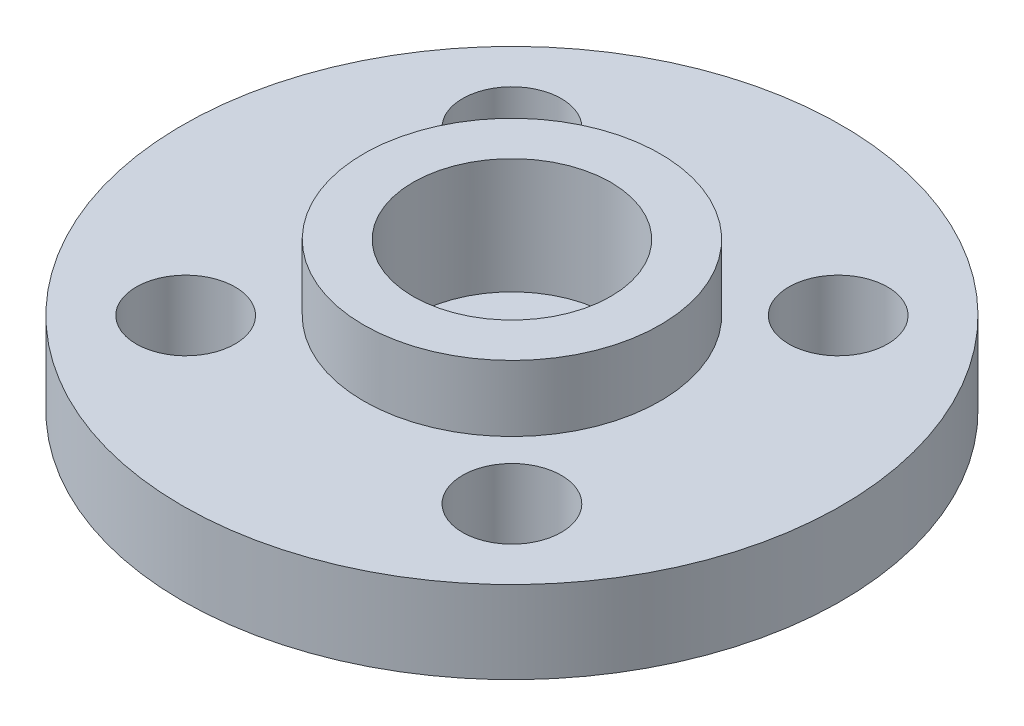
ISO-10303-21;
HEADER;
FILE_DESCRIPTION(('STEP AP214'),'2;1');
FILE_NAME('part.step','',(''),(''),'','','');
FILE_SCHEMA(('AUTOMOTIVE_DESIGN { 1 0 10303 214 1 1 1 1 }'));
ENDSEC;
DATA;
#1=APPLICATION_CONTEXT('core data for automotive mechanical design processes');
#2=APPLICATION_PROTOCOL_DEFINITION('international standard','automotive_design',2000,#1);
#3=PRODUCT_CONTEXT('',#1,'mechanical');
#4=PRODUCT('Part','Part','',(#3));
#5=PRODUCT_RELATED_PRODUCT_CATEGORY('part','',(#4));
#6=PRODUCT_DEFINITION_FORMATION('','',#4);
#7=PRODUCT_DEFINITION_CONTEXT('part definition',#1,'design');
#8=PRODUCT_DEFINITION('design','',#6,#7);
#9=PRODUCT_DEFINITION_SHAPE('','',#8);
#10=(LENGTH_UNIT() NAMED_UNIT(*) SI_UNIT(.MILLI.,.METRE.));
#11=(NAMED_UNIT(*) PLANE_ANGLE_UNIT() SI_UNIT($,.RADIAN.));
#12=(NAMED_UNIT(*) SI_UNIT($,.STERADIAN.) SOLID_ANGLE_UNIT());
#13=UNCERTAINTY_MEASURE_WITH_UNIT(LENGTH_MEASURE(1.E-05),#10,'distance_accuracy_value','');
#14=(GEOMETRIC_REPRESENTATION_CONTEXT(3) GLOBAL_UNCERTAINTY_ASSIGNED_CONTEXT((#13)) GLOBAL_UNIT_ASSIGNED_CONTEXT((#10,
#11,#12)) REPRESENTATION_CONTEXT('',''));
#15=CARTESIAN_POINT('',(0.,0.,0.));
#16=DIRECTION('',(0.,0.,1.));
#17=DIRECTION('',(1.,0.,0.));
#18=AXIS2_PLACEMENT_3D('',#15,#16,#17);
#19=CARTESIAN_POINT('',(0.,2.5,0.));
#20=DIRECTION('',(0.,-1.,0.));
#21=DIRECTION('',(0.,0.,-1.));
#22=AXIS2_PLACEMENT_3D('',#19,#20,#21);
#23=CYLINDRICAL_SURFACE('',#22,3.);
#24=CARTESIAN_POINT('',(0.,4.5,0.));
#25=DIRECTION('',(0.,1.,0.));
#26=DIRECTION('',(0.,0.,1.));
#27=AXIS2_PLACEMENT_3D('',#24,#25,#26);
#28=CIRCLE('',#27,3.);
#29=CARTESIAN_POINT('',(0.,4.5,3.));
#30=VERTEX_POINT('',#29);
#31=EDGE_CURVE('E88',#30,#30,#28,.T.);
#32=ORIENTED_EDGE('',*,*,#31,.T.);
#33=EDGE_LOOP('',(#32));
#34=FACE_BOUND('',#33,.T.);
#35=CARTESIAN_POINT('',(0.,1.,0.));
#36=DIRECTION('',(0.,-1.,0.));
#37=DIRECTION('',(0.,0.,-1.));
#38=AXIS2_PLACEMENT_3D('',#35,#36,#37);
#39=CIRCLE('',#38,3.);
#40=CARTESIAN_POINT('',(0.,1.,-3.));
#41=VERTEX_POINT('',#40);
#42=EDGE_CURVE('E95',#41,#41,#39,.T.);
#43=ORIENTED_EDGE('',*,*,#42,.T.);
#44=EDGE_LOOP('',(#43));
#45=FACE_BOUND('',#44,.T.);
#46=ADVANCED_FACE('F37',(#34,#45),#23,.F.);
#47=CARTESIAN_POINT('',(0.,2.5,0.));
#48=DIRECTION('',(0.,1.,0.));
#49=DIRECTION('',(0.,0.,1.));
#50=AXIS2_PLACEMENT_3D('',#47,#48,#49);
#51=PLANE('',#50);
#52=CARTESIAN_POINT('',(-4.94974746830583,2.5,4.9497474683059));
#53=DIRECTION('',(0.,1.,0.));
#54=DIRECTION('',(0.,0.,1.));
#55=AXIS2_PLACEMENT_3D('',#52,#53,#54);
#56=CIRCLE('',#55,1.5);
#57=CARTESIAN_POINT('',(-4.94974746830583,2.5,6.4497474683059));
#58=VERTEX_POINT('',#57);
#59=EDGE_CURVE('E64',#58,#58,#56,.T.);
#60=ORIENTED_EDGE('',*,*,#59,.F.);
#61=EDGE_LOOP('',(#60));
#62=FACE_BOUND('',#61,.T.);
#63=CARTESIAN_POINT('',(4.94974746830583,2.5,-4.9497474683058));
#64=DIRECTION('',(0.,1.,0.));
#65=DIRECTION('',(0.,0.,1.));
#66=AXIS2_PLACEMENT_3D('',#63,#64,#65);
#67=CIRCLE('',#66,1.5);
#68=CARTESIAN_POINT('',(4.94974746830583,2.5,-3.4497474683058));
#69=VERTEX_POINT('',#68);
#70=EDGE_CURVE('E50',#69,#69,#67,.T.);
#71=ORIENTED_EDGE('',*,*,#70,.F.);
#72=EDGE_LOOP('',(#71));
#73=FACE_BOUND('',#72,.T.);
#74=CARTESIAN_POINT('',(0.,2.5,0.));
#75=DIRECTION('',(0.,1.,0.));
#76=DIRECTION('',(0.,0.,1.));
#77=AXIS2_PLACEMENT_3D('',#74,#75,#76);
#78=CIRCLE('',#77,10.);
#79=CARTESIAN_POINT('',(0.,2.5,10.));
#80=VERTEX_POINT('',#79);
#81=EDGE_CURVE('E10',#80,#80,#78,.T.);
#82=ORIENTED_EDGE('',*,*,#81,.T.);
#83=EDGE_LOOP('',(#82));
#84=FACE_BOUND('',#83,.T.);
#85=CARTESIAN_POINT('',(4.94974746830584,2.5,4.94974746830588));
#86=DIRECTION('',(0.,1.,0.));
#87=DIRECTION('',(0.,0.,1.));
#88=AXIS2_PLACEMENT_3D('',#85,#86,#87);
#89=CIRCLE('',#88,1.5);
#90=CARTESIAN_POINT('',(4.94974746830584,2.5,6.44974746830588));
#91=VERTEX_POINT('',#90);
#92=EDGE_CURVE('E56',#91,#91,#89,.T.);
#93=ORIENTED_EDGE('',*,*,#92,.F.);
#94=EDGE_LOOP('',(#93));
#95=FACE_BOUND('',#94,.T.);
#96=CARTESIAN_POINT('',(-4.94974746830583,2.5,-4.9497474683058));
#97=DIRECTION('',(0.,1.,0.));
#98=DIRECTION('',(0.,0.,1.));
#99=AXIS2_PLACEMENT_3D('',#96,#97,#98);
#100=CIRCLE('',#99,1.5);
#101=CARTESIAN_POINT('',(-4.94974746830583,2.5,-3.4497474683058));
#102=VERTEX_POINT('',#101);
#103=EDGE_CURVE('E72',#102,#102,#100,.T.);
#104=ORIENTED_EDGE('',*,*,#103,.F.);
#105=EDGE_LOOP('',(#104));
#106=FACE_BOUND('',#105,.T.);
#107=CARTESIAN_POINT('',(0.,2.5,0.));
#108=DIRECTION('',(0.,1.,0.));
#109=DIRECTION('',(0.,0.,1.));
#110=AXIS2_PLACEMENT_3D('',#107,#108,#109);
#111=CIRCLE('',#110,4.5);
#112=CARTESIAN_POINT('',(0.,2.5,4.5));
#113=VERTEX_POINT('',#112);
#114=EDGE_CURVE('E84',#113,#113,#111,.T.);
#115=ORIENTED_EDGE('',*,*,#114,.F.);
#116=EDGE_LOOP('',(#115));
#117=FACE_BOUND('',#116,.T.);
#118=ADVANCED_FACE('F119',(#62,#73,#84,#95,#106,#117),#51,.T.);
#119=CARTESIAN_POINT('',(0.,0.,0.));
#120=DIRECTION('',(0.,1.,0.));
#121=DIRECTION('',(0.,0.,1.));
#122=AXIS2_PLACEMENT_3D('',#119,#120,#121);
#123=PLANE('',#122);
#124=CARTESIAN_POINT('',(0.,0.,0.));
#125=DIRECTION('',(0.,1.,0.));
#126=DIRECTION('',(0.,0.,1.));
#127=AXIS2_PLACEMENT_3D('',#124,#125,#126);
#128=CIRCLE('',#127,10.);
#129=CARTESIAN_POINT('',(0.,0.,10.));
#130=VERTEX_POINT('',#129);
#131=EDGE_CURVE('E41',#130,#130,#128,.T.);
#132=ORIENTED_EDGE('',*,*,#131,.F.);
#133=EDGE_LOOP('',(#132));
#134=FACE_BOUND('',#133,.T.);
#135=CARTESIAN_POINT('',(4.94974746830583,0.,-4.9497474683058));
#136=DIRECTION('',(0.,1.,0.));
#137=DIRECTION('',(0.,0.,1.));
#138=AXIS2_PLACEMENT_3D('',#135,#136,#137);
#139=CIRCLE('',#138,1.5);
#140=CARTESIAN_POINT('',(4.94974746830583,0.,-3.4497474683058));
#141=VERTEX_POINT('',#140);
#142=EDGE_CURVE('E52',#141,#141,#139,.T.);
#143=ORIENTED_EDGE('',*,*,#142,.T.);
#144=EDGE_LOOP('',(#143));
#145=FACE_BOUND('',#144,.T.);
#146=CARTESIAN_POINT('',(4.94974746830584,0.,4.94974746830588));
#147=DIRECTION('',(0.,1.,0.));
#148=DIRECTION('',(0.,0.,1.));
#149=AXIS2_PLACEMENT_3D('',#146,#147,#148);
#150=CIRCLE('',#149,1.5);
#151=CARTESIAN_POINT('',(4.94974746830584,0.,6.44974746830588));
#152=VERTEX_POINT('',#151);
#153=EDGE_CURVE('E60',#152,#152,#150,.T.);
#154=ORIENTED_EDGE('',*,*,#153,.T.);
#155=EDGE_LOOP('',(#154));
#156=FACE_BOUND('',#155,.T.);
#157=CARTESIAN_POINT('',(-4.94974746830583,0.,4.9497474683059));
#158=DIRECTION('',(0.,1.,0.));
#159=DIRECTION('',(0.,0.,1.));
#160=AXIS2_PLACEMENT_3D('',#157,#158,#159);
#161=CIRCLE('',#160,1.5);
#162=CARTESIAN_POINT('',(-4.94974746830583,0.,6.4497474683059));
#163=VERTEX_POINT('',#162);
#164=EDGE_CURVE('E68',#163,#163,#161,.T.);
#165=ORIENTED_EDGE('',*,*,#164,.T.);
#166=EDGE_LOOP('',(#165));
#167=FACE_BOUND('',#166,.T.);
#168=CARTESIAN_POINT('',(-4.94974746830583,0.,-4.9497474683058));
#169=DIRECTION('',(0.,1.,0.));
#170=DIRECTION('',(0.,0.,1.));
#171=AXIS2_PLACEMENT_3D('',#168,#169,#170);
#172=CIRCLE('',#171,1.5);
#173=CARTESIAN_POINT('',(-4.94974746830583,0.,-3.4497474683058));
#174=VERTEX_POINT('',#173);
#175=EDGE_CURVE('E76',#174,#174,#172,.T.);
#176=ORIENTED_EDGE('',*,*,#175,.T.);
#177=EDGE_LOOP('',(#176));
#178=FACE_BOUND('',#177,.T.);
#179=CARTESIAN_POINT('',(0.,0.,0.));
#180=DIRECTION('',(0.,-1.,0.));
#181=DIRECTION('',(0.,0.,-1.));
#182=AXIS2_PLACEMENT_3D('',#179,#180,#181);
#183=CIRCLE('',#182,1.);
#184=CARTESIAN_POINT('',(0.,0.,-1.));
#185=VERTEX_POINT('',#184);
#186=EDGE_CURVE('E100',#185,#185,#183,.T.);
#187=ORIENTED_EDGE('',*,*,#186,.F.);
#188=EDGE_LOOP('',(#187));
#189=FACE_BOUND('',#188,.T.);
#190=ADVANCED_FACE('F117',(#134,#145,#156,#167,#178,#189),#123,.F.);
#191=CARTESIAN_POINT('',(0.,2.5,0.));
#192=DIRECTION('',(0.,-1.,0.));
#193=DIRECTION('',(0.,0.,-1.));
#194=AXIS2_PLACEMENT_3D('',#191,#192,#193);
#195=CYLINDRICAL_SURFACE('',#194,10.);
#196=ORIENTED_EDGE('',*,*,#81,.F.);
#197=EDGE_LOOP('',(#196));
#198=FACE_BOUND('',#197,.T.);
#199=ORIENTED_EDGE('',*,*,#131,.T.);
#200=EDGE_LOOP('',(#199));
#201=FACE_BOUND('',#200,.T.);
#202=ADVANCED_FACE('F39',(#198,#201),#195,.T.);
#203=CARTESIAN_POINT('',(4.94974746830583,2.5,-4.9497474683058));
#204=DIRECTION('',(0.,-1.,0.));
#205=DIRECTION('',(0.,0.,-1.));
#206=AXIS2_PLACEMENT_3D('',#203,#204,#205);
#207=CYLINDRICAL_SURFACE('',#206,1.5);
#208=ORIENTED_EDGE('',*,*,#70,.T.);
#209=EDGE_LOOP('',(#208));
#210=FACE_BOUND('',#209,.T.);
#211=ORIENTED_EDGE('',*,*,#142,.F.);
#212=EDGE_LOOP('',(#211));
#213=FACE_BOUND('',#212,.T.);
#214=ADVANCED_FACE('F126',(#210,#213),#207,.F.);
#215=CARTESIAN_POINT('',(4.94974746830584,2.5,4.94974746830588));
#216=DIRECTION('',(0.,-1.,0.));
#217=DIRECTION('',(0.,0.,-1.));
#218=AXIS2_PLACEMENT_3D('',#215,#216,#217);
#219=CYLINDRICAL_SURFACE('',#218,1.5);
#220=ORIENTED_EDGE('',*,*,#92,.T.);
#221=EDGE_LOOP('',(#220));
#222=FACE_BOUND('',#221,.T.);
#223=ORIENTED_EDGE('',*,*,#153,.F.);
#224=EDGE_LOOP('',(#223));
#225=FACE_BOUND('',#224,.T.);
#226=ADVANCED_FACE('F152',(#222,#225),#219,.F.);
#227=CARTESIAN_POINT('',(-4.94974746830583,2.5,4.9497474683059));
#228=DIRECTION('',(0.,-1.,0.));
#229=DIRECTION('',(0.,0.,-1.));
#230=AXIS2_PLACEMENT_3D('',#227,#228,#229);
#231=CYLINDRICAL_SURFACE('',#230,1.5);
#232=ORIENTED_EDGE('',*,*,#59,.T.);
#233=EDGE_LOOP('',(#232));
#234=FACE_BOUND('',#233,.T.);
#235=ORIENTED_EDGE('',*,*,#164,.F.);
#236=EDGE_LOOP('',(#235));
#237=FACE_BOUND('',#236,.T.);
#238=ADVANCED_FACE('F148',(#234,#237),#231,.F.);
#239=CARTESIAN_POINT('',(-4.94974746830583,2.5,-4.9497474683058));
#240=DIRECTION('',(0.,-1.,0.));
#241=DIRECTION('',(0.,0.,-1.));
#242=AXIS2_PLACEMENT_3D('',#239,#240,#241);
#243=CYLINDRICAL_SURFACE('',#242,1.5);
#244=ORIENTED_EDGE('',*,*,#103,.T.);
#245=EDGE_LOOP('',(#244));
#246=FACE_BOUND('',#245,.T.);
#247=ORIENTED_EDGE('',*,*,#175,.F.);
#248=EDGE_LOOP('',(#247));
#249=FACE_BOUND('',#248,.T.);
#250=ADVANCED_FACE('F144',(#246,#249),#243,.F.);
#251=CARTESIAN_POINT('',(0.,4.5,0.));
#252=DIRECTION('',(0.,1.,0.));
#253=DIRECTION('',(0.,0.,1.));
#254=AXIS2_PLACEMENT_3D('',#251,#252,#253);
#255=PLANE('',#254);
#256=CARTESIAN_POINT('',(0.,4.5,0.));
#257=DIRECTION('',(0.,1.,0.));
#258=DIRECTION('',(0.,0.,1.));
#259=AXIS2_PLACEMENT_3D('',#256,#257,#258);
#260=CIRCLE('',#259,4.5);
#261=CARTESIAN_POINT('',(0.,4.5,4.5));
#262=VERTEX_POINT('',#261);
#263=EDGE_CURVE('E80',#262,#262,#260,.T.);
#264=ORIENTED_EDGE('',*,*,#263,.T.);
#265=EDGE_LOOP('',(#264));
#266=FACE_BOUND('',#265,.T.);
#267=ORIENTED_EDGE('',*,*,#31,.F.);
#268=EDGE_LOOP('',(#267));
#269=FACE_BOUND('',#268,.T.);
#270=ADVANCED_FACE('F147',(#266,#269),#255,.T.);
#271=CARTESIAN_POINT('',(0.,4.5,0.));
#272=DIRECTION('',(0.,-1.,0.));
#273=DIRECTION('',(0.,0.,-1.));
#274=AXIS2_PLACEMENT_3D('',#271,#272,#273);
#275=CYLINDRICAL_SURFACE('',#274,4.5);
#276=ORIENTED_EDGE('',*,*,#263,.F.);
#277=EDGE_LOOP('',(#276));
#278=FACE_BOUND('',#277,.T.);
#279=ORIENTED_EDGE('',*,*,#114,.T.);
#280=EDGE_LOOP('',(#279));
#281=FACE_BOUND('',#280,.T.);
#282=ADVANCED_FACE('F142',(#278,#281),#275,.T.);
#283=CARTESIAN_POINT('',(0.,1.,0.));
#284=DIRECTION('',(0.,-1.,0.));
#285=DIRECTION('',(0.,0.,-1.));
#286=AXIS2_PLACEMENT_3D('',#283,#284,#285);
#287=PLANE('',#286);
#288=CARTESIAN_POINT('',(0.,1.,0.));
#289=DIRECTION('',(0.,-1.,0.));
#290=DIRECTION('',(0.,0.,-1.));
#291=AXIS2_PLACEMENT_3D('',#288,#289,#290);
#292=CIRCLE('',#291,1.);
#293=CARTESIAN_POINT('',(0.,1.,-1.));
#294=VERTEX_POINT('',#293);
#295=EDGE_CURVE('E99',#294,#294,#292,.T.);
#296=ORIENTED_EDGE('',*,*,#295,.T.);
#297=EDGE_LOOP('',(#296));
#298=FACE_BOUND('',#297,.T.);
#299=ORIENTED_EDGE('',*,*,#42,.F.);
#300=EDGE_LOOP('',(#299));
#301=FACE_BOUND('',#300,.T.);
#302=ADVANCED_FACE('F108',(#298,#301),#287,.F.);
#303=CARTESIAN_POINT('',(0.,1.,0.));
#304=DIRECTION('',(0.,-1.,0.));
#305=DIRECTION('',(0.,0.,-1.));
#306=AXIS2_PLACEMENT_3D('',#303,#304,#305);
#307=CYLINDRICAL_SURFACE('',#306,1.);
#308=ORIENTED_EDGE('',*,*,#295,.F.);
#309=EDGE_LOOP('',(#308));
#310=FACE_BOUND('',#309,.T.);
#311=ORIENTED_EDGE('',*,*,#186,.T.);
#312=EDGE_LOOP('',(#311));
#313=FACE_BOUND('',#312,.T.);
#314=ADVANCED_FACE('F111',(#310,#313),#307,.F.);
#315=CLOSED_SHELL('',(#46,#118,#190,#202,#214,#226,#238,#250,#270,#282,#302,#314));
#316=MANIFOLD_SOLID_BREP('B2',#315);
#317=ADVANCED_BREP_SHAPE_REPRESENTATION('',(#18,#316),#14);
#318=SHAPE_DEFINITION_REPRESENTATION(#9,#317);
ENDSEC;
END-ISO-10303-21;
